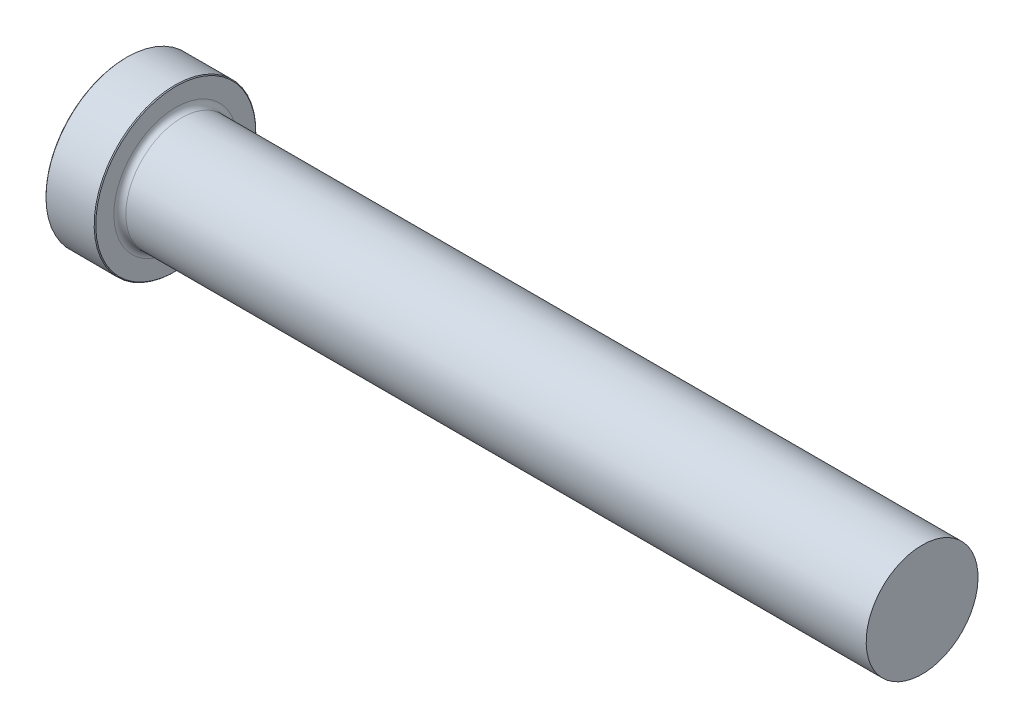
from build123d import *

# Parameters (mm, degrees)
CHAMFER1_SIZE = 0.1016


with BuildPart() as part:
    # Sketch1 → Revolve1 (revolve)
    with BuildSketch(Plane.XY):
        with BuildLine():
            Line((0, 0), (0, 10.31875))
            Line((0, 10.31875), (6.35, 10.31875))
            Line((6.35, 10.31875), (6.35, 7.8994))
            ThreePointArc((6.35, 7.8994), (6.573184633, 7.360584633), (7.112, 7.1374))
            Line((7.112, 7.1374), (101.6, 7.1374))
            Line((101.6, 7.1374), (101.6, 0))
            Line((101.6, 0), (0, 0))
        make_face()
    revolve(axis=Axis((101.6, 0, 0), (-1, 0, 0)))

    # Chamfer1
    chamfer1_edges = [part.edges().sort_by_distance(p)[0] for p in [
        (0, -10.31875, 0),
        (6.35, -10.31875, 0),
    ]]
    chamfer(chamfer1_edges, length=CHAMFER1_SIZE)


solid = part.part
